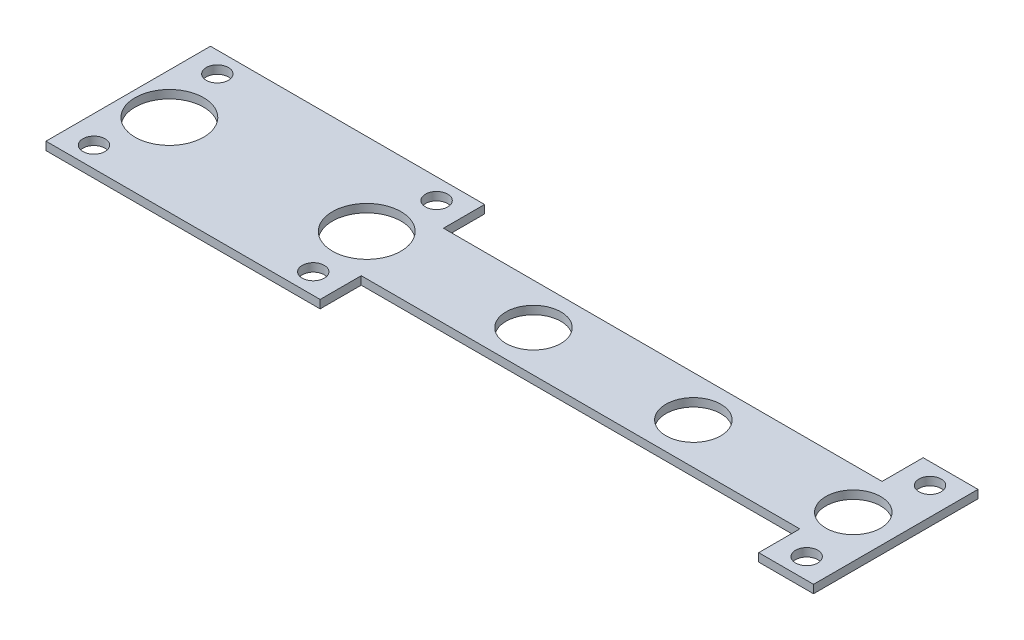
ISO-10303-21;
HEADER;
FILE_DESCRIPTION(('STEP AP214'),'2;1');
FILE_NAME('part.step','',(''),(''),'','','');
FILE_SCHEMA(('AUTOMOTIVE_DESIGN { 1 0 10303 214 1 1 1 1 }'));
ENDSEC;
DATA;
#1=APPLICATION_CONTEXT('core data for automotive mechanical design processes');
#2=APPLICATION_PROTOCOL_DEFINITION('international standard','automotive_design',2000,#1);
#3=PRODUCT_CONTEXT('',#1,'mechanical');
#4=PRODUCT('Part','Part','',(#3));
#5=PRODUCT_RELATED_PRODUCT_CATEGORY('part','',(#4));
#6=PRODUCT_DEFINITION_FORMATION('','',#4);
#7=PRODUCT_DEFINITION_CONTEXT('part definition',#1,'design');
#8=PRODUCT_DEFINITION('design','',#6,#7);
#9=PRODUCT_DEFINITION_SHAPE('','',#8);
#10=(LENGTH_UNIT() NAMED_UNIT(*) SI_UNIT(.MILLI.,.METRE.));
#11=(NAMED_UNIT(*) PLANE_ANGLE_UNIT() SI_UNIT($,.RADIAN.));
#12=(NAMED_UNIT(*) SI_UNIT($,.STERADIAN.) SOLID_ANGLE_UNIT());
#13=UNCERTAINTY_MEASURE_WITH_UNIT(LENGTH_MEASURE(1.E-05),#10,'distance_accuracy_value','');
#14=(GEOMETRIC_REPRESENTATION_CONTEXT(3) GLOBAL_UNCERTAINTY_ASSIGNED_CONTEXT((#13)) GLOBAL_UNIT_ASSIGNED_CONTEXT((#10,
#11,#12)) REPRESENTATION_CONTEXT('',''));
#15=CARTESIAN_POINT('',(0.,0.,0.));
#16=DIRECTION('',(0.,0.,1.));
#17=DIRECTION('',(1.,0.,0.));
#18=AXIS2_PLACEMENT_3D('',#15,#16,#17);
#19=CARTESIAN_POINT('',(0.,3.,0.));
#20=DIRECTION('',(0.,1.,0.));
#21=DIRECTION('',(0.,0.,1.));
#22=AXIS2_PLACEMENT_3D('',#19,#20,#21);
#23=PLANE('',#22);
#24=CARTESIAN_POINT('',(45.0731259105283,3.,-0.336908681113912));
#25=DIRECTION('',(0.,1.,0.));
#26=DIRECTION('',(0.,0.,1.));
#27=AXIS2_PLACEMENT_3D('',#24,#25,#26);
#28=CIRCLE('',#27,10.);
#29=CARTESIAN_POINT('',(45.0731259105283,3.,9.66309131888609));
#30=VERTEX_POINT('',#29);
#31=EDGE_CURVE('E319',#30,#30,#28,.T.);
#32=ORIENTED_EDGE('',*,*,#31,.F.);
#33=EDGE_LOOP('',(#32));
#34=FACE_BOUND('',#33,.T.);
#35=CARTESIAN_POINT('',(-15.7602074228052,3.,-0.336908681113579));
#36=DIRECTION('',(0.,1.,0.));
#37=DIRECTION('',(0.,0.,1.));
#38=AXIS2_PLACEMENT_3D('',#35,#36,#37);
#39=CIRCLE('',#38,12.5);
#40=CARTESIAN_POINT('',(-15.7602074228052,3.,12.1630913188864));
#41=VERTEX_POINT('',#40);
#42=EDGE_CURVE('E331',#41,#41,#39,.T.);
#43=ORIENTED_EDGE('',*,*,#42,.F.);
#44=EDGE_LOOP('',(#43));
#45=FACE_BOUND('',#44,.T.);
#46=CARTESIAN_POINT('',(-87.7602074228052,3.,-0.336908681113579));
#47=DIRECTION('',(0.,1.,0.));
#48=DIRECTION('',(0.,0.,1.));
#49=AXIS2_PLACEMENT_3D('',#46,#47,#48);
#50=CIRCLE('',#49,12.5);
#51=CARTESIAN_POINT('',(-87.7602074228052,3.,12.1630913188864));
#52=VERTEX_POINT('',#51);
#53=EDGE_CURVE('E343',#52,#52,#50,.T.);
#54=ORIENTED_EDGE('',*,*,#53,.F.);
#55=EDGE_LOOP('',(#54));
#56=FACE_BOUND('',#55,.T.);
#57=CARTESIAN_POINT('',(167.239792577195,3.,-22.8369086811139));
#58=DIRECTION('',(0.,1.,0.));
#59=DIRECTION('',(0.,0.,1.));
#60=AXIS2_PLACEMENT_3D('',#57,#58,#59);
#61=CIRCLE('',#60,4.04999999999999);
#62=CARTESIAN_POINT('',(167.239792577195,3.,-18.7869086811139));
#63=VERTEX_POINT('',#62);
#64=EDGE_CURVE('E355',#63,#63,#61,.T.);
#65=ORIENTED_EDGE('',*,*,#64,.F.);
#66=EDGE_LOOP('',(#65));
#67=FACE_BOUND('',#66,.T.);
#68=CARTESIAN_POINT('',(167.239792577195,3.,22.1630913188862));
#69=DIRECTION('',(0.,1.,0.));
#70=DIRECTION('',(0.,0.,1.));
#71=AXIS2_PLACEMENT_3D('',#68,#69,#70);
#72=CIRCLE('',#71,4.04999999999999);
#73=CARTESIAN_POINT('',(167.239792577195,3.,26.2130913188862));
#74=VERTEX_POINT('',#73);
#75=EDGE_CURVE('E367',#74,#74,#72,.T.);
#76=ORIENTED_EDGE('',*,*,#75,.F.);
#77=EDGE_LOOP('',(#76));
#78=FACE_BOUND('',#77,.T.);
#79=DIRECTION('',(0.,0.,1.));
#80=VECTOR('',#79,1.);
#81=CARTESIAN_POINT('',(-102.760207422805,3.,-30.3369086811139));
#82=LINE('',#81,#80);
#83=CARTESIAN_POINT('',(-102.760207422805,3.,-30.3369086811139));
#84=VERTEX_POINT('',#83);
#85=CARTESIAN_POINT('',(-102.760207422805,3.,29.663091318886));
#86=VERTEX_POINT('',#85);
#87=EDGE_CURVE('E176',#84,#86,#82,.T.);
#88=ORIENTED_EDGE('',*,*,#87,.T.);
#89=DIRECTION('',(1.,0.,0.));
#90=VECTOR('',#89,1.);
#91=CARTESIAN_POINT('',(-102.760207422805,3.,29.663091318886));
#92=LINE('',#91,#90);
#93=CARTESIAN_POINT('',(-2.76020742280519,3.,29.663091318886));
#94=VERTEX_POINT('',#93);
#95=EDGE_CURVE('E104',#86,#94,#92,.T.);
#96=ORIENTED_EDGE('',*,*,#95,.T.);
#97=DIRECTION('',(0.,0.,-1.));
#98=VECTOR('',#97,1.);
#99=CARTESIAN_POINT('',(-2.76020742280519,3.,29.663091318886));
#100=LINE('',#99,#98);
#101=CARTESIAN_POINT('',(-2.76020742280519,3.,14.663091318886));
#102=VERTEX_POINT('',#101);
#103=EDGE_CURVE('E203',#94,#102,#100,.T.);
#104=ORIENTED_EDGE('',*,*,#103,.T.);
#105=DIRECTION('',(1.,0.,0.));
#106=VECTOR('',#105,1.);
#107=CARTESIAN_POINT('',(-2.76020742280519,3.,14.663091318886));
#108=LINE('',#107,#106);
#109=CARTESIAN_POINT('',(157.239792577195,3.,14.663091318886));
#110=VERTEX_POINT('',#109);
#111=EDGE_CURVE('E222',#102,#110,#108,.T.);
#112=ORIENTED_EDGE('',*,*,#111,.T.);
#113=DIRECTION('',(0.,0.,1.));
#114=VECTOR('',#113,1.);
#115=CARTESIAN_POINT('',(157.239792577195,3.,14.663091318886));
#116=LINE('',#115,#114);
#117=CARTESIAN_POINT('',(157.239792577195,3.,29.663091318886));
#118=VERTEX_POINT('',#117);
#119=EDGE_CURVE('E219',#110,#118,#116,.T.);
#120=ORIENTED_EDGE('',*,*,#119,.T.);
#121=DIRECTION('',(1.,0.,0.));
#122=VECTOR('',#121,1.);
#123=CARTESIAN_POINT('',(157.239792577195,3.,29.663091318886));
#124=LINE('',#123,#122);
#125=CARTESIAN_POINT('',(177.239792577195,3.,29.663091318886));
#126=VERTEX_POINT('',#125);
#127=EDGE_CURVE('E221',#118,#126,#124,.T.);
#128=ORIENTED_EDGE('',*,*,#127,.T.);
#129=DIRECTION('',(0.,0.,-1.));
#130=VECTOR('',#129,1.);
#131=CARTESIAN_POINT('',(177.239792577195,3.,29.663091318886));
#132=LINE('',#131,#130);
#133=CARTESIAN_POINT('',(177.239792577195,3.,-30.3369086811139));
#134=VERTEX_POINT('',#133);
#135=EDGE_CURVE('E224',#126,#134,#132,.T.);
#136=ORIENTED_EDGE('',*,*,#135,.T.);
#137=DIRECTION('',(-1.,0.,0.));
#138=VECTOR('',#137,1.);
#139=CARTESIAN_POINT('',(177.239792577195,3.,-30.3369086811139));
#140=LINE('',#139,#138);
#141=CARTESIAN_POINT('',(157.239792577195,3.,-30.3369086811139));
#142=VERTEX_POINT('',#141);
#143=EDGE_CURVE('E230',#134,#142,#140,.T.);
#144=ORIENTED_EDGE('',*,*,#143,.T.);
#145=DIRECTION('',(0.,0.,1.));
#146=VECTOR('',#145,1.);
#147=CARTESIAN_POINT('',(157.239792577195,3.,-30.3369086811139));
#148=LINE('',#147,#146);
#149=CARTESIAN_POINT('',(157.239792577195,3.,-15.3369086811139));
#150=VERTEX_POINT('',#149);
#151=EDGE_CURVE('E135',#142,#150,#148,.T.);
#152=ORIENTED_EDGE('',*,*,#151,.T.);
#153=DIRECTION('',(-1.,0.,0.));
#154=VECTOR('',#153,1.);
#155=CARTESIAN_POINT('',(157.239792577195,3.,-15.3369086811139));
#156=LINE('',#155,#154);
#157=CARTESIAN_POINT('',(-2.76020742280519,3.,-15.3369086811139));
#158=VERTEX_POINT('',#157);
#159=EDGE_CURVE('E129',#150,#158,#156,.T.);
#160=ORIENTED_EDGE('',*,*,#159,.T.);
#161=DIRECTION('',(0.,0.,-1.));
#162=VECTOR('',#161,1.);
#163=CARTESIAN_POINT('',(-2.76020742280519,3.,-15.3369086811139));
#164=LINE('',#163,#162);
#165=CARTESIAN_POINT('',(-2.76020742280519,3.,-30.3369086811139));
#166=VERTEX_POINT('',#165);
#167=EDGE_CURVE('E133',#158,#166,#164,.T.);
#168=ORIENTED_EDGE('',*,*,#167,.T.);
#169=DIRECTION('',(-1.,0.,0.));
#170=VECTOR('',#169,1.);
#171=CARTESIAN_POINT('',(-2.76020742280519,3.,-30.3369086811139));
#172=LINE('',#171,#170);
#173=EDGE_CURVE('E49',#166,#84,#172,.T.);
#174=ORIENTED_EDGE('',*,*,#173,.T.);
#175=EDGE_LOOP('',(#88,#96,#104,#112,#120,#128,#136,#144,#152,#160,#168,#174));
#176=FACE_BOUND('',#175,.T.);
#177=CARTESIAN_POINT('',(-12.76020742,3.,22.163091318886));
#178=DIRECTION('',(0.,1.,0.));
#179=DIRECTION('',(0.,0.,1.));
#180=AXIS2_PLACEMENT_3D('',#177,#178,#179);
#181=CIRCLE('',#180,4.04999999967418);
#182=CARTESIAN_POINT('',(-12.76020742,3.,26.2130913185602));
#183=VERTEX_POINT('',#182);
#184=EDGE_CURVE('E157',#183,#183,#181,.T.);
#185=ORIENTED_EDGE('',*,*,#184,.F.);
#186=EDGE_LOOP('',(#185));
#187=FACE_BOUND('',#186,.T.);
#188=CARTESIAN_POINT('',(-92.76020742,3.,22.1630913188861));
#189=DIRECTION('',(0.,1.,0.));
#190=DIRECTION('',(0.,0.,1.));
#191=AXIS2_PLACEMENT_3D('',#188,#189,#190);
#192=CIRCLE('',#191,4.04999999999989);
#193=CARTESIAN_POINT('',(-92.76020742,3.,26.2130913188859));
#194=VERTEX_POINT('',#193);
#195=EDGE_CURVE('E361',#194,#194,#192,.T.);
#196=ORIENTED_EDGE('',*,*,#195,.F.);
#197=EDGE_LOOP('',(#196));
#198=FACE_BOUND('',#197,.T.);
#199=CARTESIAN_POINT('',(-92.76020742,3.,-22.8369086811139));
#200=DIRECTION('',(0.,1.,0.));
#201=DIRECTION('',(0.,0.,1.));
#202=AXIS2_PLACEMENT_3D('',#199,#200,#201);
#203=CIRCLE('',#202,4.05);
#204=CARTESIAN_POINT('',(-92.76020742,3.,-18.7869086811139));
#205=VERTEX_POINT('',#204);
#206=EDGE_CURVE('E349',#205,#205,#203,.T.);
#207=ORIENTED_EDGE('',*,*,#206,.F.);
#208=EDGE_LOOP('',(#207));
#209=FACE_BOUND('',#208,.T.);
#210=CARTESIAN_POINT('',(161.739792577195,3.,-0.336908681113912));
#211=DIRECTION('',(0.,1.,0.));
#212=DIRECTION('',(0.,0.,1.));
#213=AXIS2_PLACEMENT_3D('',#210,#211,#212);
#214=CIRCLE('',#213,10.);
#215=CARTESIAN_POINT('',(161.739792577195,3.,9.6630913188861));
#216=VERTEX_POINT('',#215);
#217=EDGE_CURVE('E337',#216,#216,#214,.T.);
#218=ORIENTED_EDGE('',*,*,#217,.F.);
#219=EDGE_LOOP('',(#218));
#220=FACE_BOUND('',#219,.T.);
#221=CARTESIAN_POINT('',(-12.76020742,3.,-22.83690868));
#222=DIRECTION('',(0.,1.,0.));
#223=DIRECTION('',(0.,0.,1.));
#224=AXIS2_PLACEMENT_3D('',#221,#222,#223);
#225=CIRCLE('',#224,4.05);
#226=CARTESIAN_POINT('',(-12.76020742,3.,-18.78690868));
#227=VERTEX_POINT('',#226);
#228=EDGE_CURVE('E325',#227,#227,#225,.T.);
#229=ORIENTED_EDGE('',*,*,#228,.F.);
#230=EDGE_LOOP('',(#229));
#231=FACE_BOUND('',#230,.T.);
#232=CARTESIAN_POINT('',(103.406459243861,3.,-0.336908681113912));
#233=DIRECTION('',(0.,1.,0.));
#234=DIRECTION('',(0.,0.,1.));
#235=AXIS2_PLACEMENT_3D('',#232,#233,#234);
#236=CIRCLE('',#235,10.);
#237=CARTESIAN_POINT('',(103.406459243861,3.,9.6630913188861));
#238=VERTEX_POINT('',#237);
#239=EDGE_CURVE('E310',#238,#238,#236,.T.);
#240=ORIENTED_EDGE('',*,*,#239,.F.);
#241=EDGE_LOOP('',(#240));
#242=FACE_BOUND('',#241,.T.);
#243=ADVANCED_FACE('F32',(#34,#45,#56,#67,#78,#176,#187,#198,#209,#220,#231,#242),#23,.T.);
#244=CARTESIAN_POINT('',(0.,0.,0.));
#245=DIRECTION('',(0.,1.,0.));
#246=DIRECTION('',(0.,0.,1.));
#247=AXIS2_PLACEMENT_3D('',#244,#245,#246);
#248=PLANE('',#247);
#249=CARTESIAN_POINT('',(45.0731259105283,0.,-0.336908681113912));
#250=DIRECTION('',(0.,1.,0.));
#251=DIRECTION('',(0.,0.,1.));
#252=AXIS2_PLACEMENT_3D('',#249,#250,#251);
#253=CIRCLE('',#252,10.);
#254=CARTESIAN_POINT('',(45.0731259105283,0.,9.66309131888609));
#255=VERTEX_POINT('',#254);
#256=EDGE_CURVE('E316',#255,#255,#253,.T.);
#257=ORIENTED_EDGE('',*,*,#256,.T.);
#258=EDGE_LOOP('',(#257));
#259=FACE_BOUND('',#258,.T.);
#260=CARTESIAN_POINT('',(-15.7602074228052,0.,-0.336908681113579));
#261=DIRECTION('',(0.,1.,0.));
#262=DIRECTION('',(0.,0.,1.));
#263=AXIS2_PLACEMENT_3D('',#260,#261,#262);
#264=CIRCLE('',#263,12.5);
#265=CARTESIAN_POINT('',(-15.7602074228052,0.,12.1630913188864));
#266=VERTEX_POINT('',#265);
#267=EDGE_CURVE('E328',#266,#266,#264,.T.);
#268=ORIENTED_EDGE('',*,*,#267,.T.);
#269=EDGE_LOOP('',(#268));
#270=FACE_BOUND('',#269,.T.);
#271=CARTESIAN_POINT('',(-87.7602074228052,0.,-0.336908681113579));
#272=DIRECTION('',(0.,1.,0.));
#273=DIRECTION('',(0.,0.,1.));
#274=AXIS2_PLACEMENT_3D('',#271,#272,#273);
#275=CIRCLE('',#274,12.5);
#276=CARTESIAN_POINT('',(-87.7602074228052,0.,12.1630913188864));
#277=VERTEX_POINT('',#276);
#278=EDGE_CURVE('E340',#277,#277,#275,.T.);
#279=ORIENTED_EDGE('',*,*,#278,.T.);
#280=EDGE_LOOP('',(#279));
#281=FACE_BOUND('',#280,.T.);
#282=CARTESIAN_POINT('',(167.239792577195,0.,-22.8369086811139));
#283=DIRECTION('',(0.,1.,0.));
#284=DIRECTION('',(0.,0.,1.));
#285=AXIS2_PLACEMENT_3D('',#282,#283,#284);
#286=CIRCLE('',#285,4.04999999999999);
#287=CARTESIAN_POINT('',(167.239792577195,0.,-18.7869086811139));
#288=VERTEX_POINT('',#287);
#289=EDGE_CURVE('E352',#288,#288,#286,.T.);
#290=ORIENTED_EDGE('',*,*,#289,.T.);
#291=EDGE_LOOP('',(#290));
#292=FACE_BOUND('',#291,.T.);
#293=CARTESIAN_POINT('',(167.239792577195,0.,22.1630913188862));
#294=DIRECTION('',(0.,1.,0.));
#295=DIRECTION('',(0.,0.,1.));
#296=AXIS2_PLACEMENT_3D('',#293,#294,#295);
#297=CIRCLE('',#296,4.04999999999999);
#298=CARTESIAN_POINT('',(167.239792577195,0.,26.2130913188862));
#299=VERTEX_POINT('',#298);
#300=EDGE_CURVE('E364',#299,#299,#297,.T.);
#301=ORIENTED_EDGE('',*,*,#300,.T.);
#302=EDGE_LOOP('',(#301));
#303=FACE_BOUND('',#302,.T.);
#304=DIRECTION('',(0.,0.,1.));
#305=VECTOR('',#304,1.);
#306=CARTESIAN_POINT('',(-102.760207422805,0.,-30.3369086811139));
#307=LINE('',#306,#305);
#308=CARTESIAN_POINT('',(-102.760207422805,0.,-30.3369086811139));
#309=VERTEX_POINT('',#308);
#310=CARTESIAN_POINT('',(-102.760207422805,0.,29.663091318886));
#311=VERTEX_POINT('',#310);
#312=EDGE_CURVE('E153',#309,#311,#307,.T.);
#313=ORIENTED_EDGE('',*,*,#312,.F.);
#314=DIRECTION('',(-1.,0.,0.));
#315=VECTOR('',#314,1.);
#316=CARTESIAN_POINT('',(-2.76020742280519,0.,-30.3369086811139));
#317=LINE('',#316,#315);
#318=CARTESIAN_POINT('',(-2.76020742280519,0.,-30.3369086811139));
#319=VERTEX_POINT('',#318);
#320=EDGE_CURVE('E96',#319,#309,#317,.T.);
#321=ORIENTED_EDGE('',*,*,#320,.F.);
#322=DIRECTION('',(0.,0.,-1.));
#323=VECTOR('',#322,1.);
#324=CARTESIAN_POINT('',(-2.76020742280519,0.,-15.3369086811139));
#325=LINE('',#324,#323);
#326=CARTESIAN_POINT('',(-2.76020742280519,0.,-15.3369086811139));
#327=VERTEX_POINT('',#326);
#328=EDGE_CURVE('E90',#327,#319,#325,.T.);
#329=ORIENTED_EDGE('',*,*,#328,.F.);
#330=DIRECTION('',(-1.,0.,0.));
#331=VECTOR('',#330,1.);
#332=CARTESIAN_POINT('',(157.239792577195,0.,-15.3369086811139));
#333=LINE('',#332,#331);
#334=CARTESIAN_POINT('',(157.239792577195,0.,-15.3369086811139));
#335=VERTEX_POINT('',#334);
#336=EDGE_CURVE('E143',#335,#327,#333,.T.);
#337=ORIENTED_EDGE('',*,*,#336,.F.);
#338=DIRECTION('',(0.,0.,1.));
#339=VECTOR('',#338,1.);
#340=CARTESIAN_POINT('',(157.239792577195,0.,-30.3369086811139));
#341=LINE('',#340,#339);
#342=CARTESIAN_POINT('',(157.239792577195,0.,-30.3369086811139));
#343=VERTEX_POINT('',#342);
#344=EDGE_CURVE('E171',#343,#335,#341,.T.);
#345=ORIENTED_EDGE('',*,*,#344,.F.);
#346=DIRECTION('',(-1.,0.,0.));
#347=VECTOR('',#346,1.);
#348=CARTESIAN_POINT('',(177.239792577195,0.,-30.3369086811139));
#349=LINE('',#348,#347);
#350=CARTESIAN_POINT('',(177.239792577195,0.,-30.3369086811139));
#351=VERTEX_POINT('',#350);
#352=EDGE_CURVE('E169',#351,#343,#349,.T.);
#353=ORIENTED_EDGE('',*,*,#352,.F.);
#354=DIRECTION('',(0.,0.,-1.));
#355=VECTOR('',#354,1.);
#356=CARTESIAN_POINT('',(177.239792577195,0.,29.663091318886));
#357=LINE('',#356,#355);
#358=CARTESIAN_POINT('',(177.239792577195,0.,29.663091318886));
#359=VERTEX_POINT('',#358);
#360=EDGE_CURVE('E167',#359,#351,#357,.T.);
#361=ORIENTED_EDGE('',*,*,#360,.F.);
#362=DIRECTION('',(1.,0.,0.));
#363=VECTOR('',#362,1.);
#364=CARTESIAN_POINT('',(157.239792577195,0.,29.663091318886));
#365=LINE('',#364,#363);
#366=CARTESIAN_POINT('',(157.239792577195,0.,29.663091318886));
#367=VERTEX_POINT('',#366);
#368=EDGE_CURVE('E165',#367,#359,#365,.T.);
#369=ORIENTED_EDGE('',*,*,#368,.F.);
#370=DIRECTION('',(0.,0.,1.));
#371=VECTOR('',#370,1.);
#372=CARTESIAN_POINT('',(157.239792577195,0.,14.663091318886));
#373=LINE('',#372,#371);
#374=CARTESIAN_POINT('',(157.239792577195,0.,14.663091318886));
#375=VERTEX_POINT('',#374);
#376=EDGE_CURVE('E163',#375,#367,#373,.T.);
#377=ORIENTED_EDGE('',*,*,#376,.F.);
#378=DIRECTION('',(1.,0.,0.));
#379=VECTOR('',#378,1.);
#380=CARTESIAN_POINT('',(-2.76020742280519,0.,14.663091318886));
#381=LINE('',#380,#379);
#382=CARTESIAN_POINT('',(-2.76020742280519,0.,14.663091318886));
#383=VERTEX_POINT('',#382);
#384=EDGE_CURVE('E161',#383,#375,#381,.T.);
#385=ORIENTED_EDGE('',*,*,#384,.F.);
#386=DIRECTION('',(0.,0.,-1.));
#387=VECTOR('',#386,1.);
#388=CARTESIAN_POINT('',(-2.76020742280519,0.,29.663091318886));
#389=LINE('',#388,#387);
#390=CARTESIAN_POINT('',(-2.76020742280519,0.,29.663091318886));
#391=VERTEX_POINT('',#390);
#392=EDGE_CURVE('E159',#391,#383,#389,.T.);
#393=ORIENTED_EDGE('',*,*,#392,.F.);
#394=DIRECTION('',(1.,0.,0.));
#395=VECTOR('',#394,1.);
#396=CARTESIAN_POINT('',(-102.760207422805,0.,29.663091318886));
#397=LINE('',#396,#395);
#398=EDGE_CURVE('E156',#311,#391,#397,.T.);
#399=ORIENTED_EDGE('',*,*,#398,.F.);
#400=EDGE_LOOP('',(#313,#321,#329,#337,#345,#353,#361,#369,#377,#385,#393,#399));
#401=FACE_BOUND('',#400,.T.);
#402=CARTESIAN_POINT('',(-12.76020742,0.,22.163091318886));
#403=DIRECTION('',(0.,1.,0.));
#404=DIRECTION('',(0.,0.,1.));
#405=AXIS2_PLACEMENT_3D('',#402,#403,#404);
#406=CIRCLE('',#405,4.04999999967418);
#407=CARTESIAN_POINT('',(-12.76020742,0.,26.2130913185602));
#408=VERTEX_POINT('',#407);
#409=EDGE_CURVE('E370',#408,#408,#406,.T.);
#410=ORIENTED_EDGE('',*,*,#409,.T.);
#411=EDGE_LOOP('',(#410));
#412=FACE_BOUND('',#411,.T.);
#413=CARTESIAN_POINT('',(-92.76020742,0.,22.1630913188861));
#414=DIRECTION('',(0.,1.,0.));
#415=DIRECTION('',(0.,0.,1.));
#416=AXIS2_PLACEMENT_3D('',#413,#414,#415);
#417=CIRCLE('',#416,4.04999999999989);
#418=CARTESIAN_POINT('',(-92.76020742,0.,26.2130913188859));
#419=VERTEX_POINT('',#418);
#420=EDGE_CURVE('E358',#419,#419,#417,.T.);
#421=ORIENTED_EDGE('',*,*,#420,.T.);
#422=EDGE_LOOP('',(#421));
#423=FACE_BOUND('',#422,.T.);
#424=CARTESIAN_POINT('',(-92.76020742,0.,-22.8369086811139));
#425=DIRECTION('',(0.,1.,0.));
#426=DIRECTION('',(0.,0.,1.));
#427=AXIS2_PLACEMENT_3D('',#424,#425,#426);
#428=CIRCLE('',#427,4.05);
#429=CARTESIAN_POINT('',(-92.76020742,0.,-18.7869086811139));
#430=VERTEX_POINT('',#429);
#431=EDGE_CURVE('E346',#430,#430,#428,.T.);
#432=ORIENTED_EDGE('',*,*,#431,.T.);
#433=EDGE_LOOP('',(#432));
#434=FACE_BOUND('',#433,.T.);
#435=CARTESIAN_POINT('',(161.739792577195,0.,-0.336908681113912));
#436=DIRECTION('',(0.,1.,0.));
#437=DIRECTION('',(0.,0.,1.));
#438=AXIS2_PLACEMENT_3D('',#435,#436,#437);
#439=CIRCLE('',#438,10.);
#440=CARTESIAN_POINT('',(161.739792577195,0.,9.6630913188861));
#441=VERTEX_POINT('',#440);
#442=EDGE_CURVE('E334',#441,#441,#439,.T.);
#443=ORIENTED_EDGE('',*,*,#442,.T.);
#444=EDGE_LOOP('',(#443));
#445=FACE_BOUND('',#444,.T.);
#446=CARTESIAN_POINT('',(-12.76020742,0.,-22.83690868));
#447=DIRECTION('',(0.,1.,0.));
#448=DIRECTION('',(0.,0.,1.));
#449=AXIS2_PLACEMENT_3D('',#446,#447,#448);
#450=CIRCLE('',#449,4.05);
#451=CARTESIAN_POINT('',(-12.76020742,0.,-18.78690868));
#452=VERTEX_POINT('',#451);
#453=EDGE_CURVE('E322',#452,#452,#450,.T.);
#454=ORIENTED_EDGE('',*,*,#453,.T.);
#455=EDGE_LOOP('',(#454));
#456=FACE_BOUND('',#455,.T.);
#457=CARTESIAN_POINT('',(103.406459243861,0.,-0.336908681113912));
#458=DIRECTION('',(0.,1.,0.));
#459=DIRECTION('',(0.,0.,1.));
#460=AXIS2_PLACEMENT_3D('',#457,#458,#459);
#461=CIRCLE('',#460,10.);
#462=CARTESIAN_POINT('',(103.406459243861,0.,9.6630913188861));
#463=VERTEX_POINT('',#462);
#464=EDGE_CURVE('E313',#463,#463,#461,.T.);
#465=ORIENTED_EDGE('',*,*,#464,.T.);
#466=EDGE_LOOP('',(#465));
#467=FACE_BOUND('',#466,.T.);
#468=ADVANCED_FACE('F207',(#259,#270,#281,#292,#303,#401,#412,#423,#434,#445,#456,#467),#248,.F.);
#469=CARTESIAN_POINT('',(-102.760207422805,3.,-30.3369086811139));
#470=DIRECTION('',(1.,0.,0.));
#471=DIRECTION('',(0.,0.,-1.));
#472=AXIS2_PLACEMENT_3D('',#469,#470,#471);
#473=PLANE('',#472);
#474=ORIENTED_EDGE('',*,*,#312,.T.);
#475=DIRECTION('',(0.,-1.,0.));
#476=VECTOR('',#475,1.);
#477=CARTESIAN_POINT('',(-102.760207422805,3.,29.663091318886));
#478=LINE('',#477,#476);
#479=EDGE_CURVE('E11',#86,#311,#478,.T.);
#480=ORIENTED_EDGE('',*,*,#479,.F.);
#481=ORIENTED_EDGE('',*,*,#87,.F.);
#482=DIRECTION('',(0.,-1.,0.));
#483=VECTOR('',#482,1.);
#484=CARTESIAN_POINT('',(-102.760207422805,3.,-30.3369086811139));
#485=LINE('',#484,#483);
#486=EDGE_CURVE('E149',#84,#309,#485,.T.);
#487=ORIENTED_EDGE('',*,*,#486,.T.);
#488=EDGE_LOOP('',(#474,#480,#481,#487));
#489=FACE_BOUND('',#488,.T.);
#490=ADVANCED_FACE('F34',(#489),#473,.F.);
#491=CARTESIAN_POINT('',(-102.760207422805,3.,29.663091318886));
#492=DIRECTION('',(0.,0.,-1.));
#493=DIRECTION('',(-1.,0.,0.));
#494=AXIS2_PLACEMENT_3D('',#491,#492,#493);
#495=PLANE('',#494);
#496=ORIENTED_EDGE('',*,*,#398,.T.);
#497=DIRECTION('',(0.,-1.,0.));
#498=VECTOR('',#497,1.);
#499=CARTESIAN_POINT('',(-2.76020742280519,3.,29.663091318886));
#500=LINE('',#499,#498);
#501=EDGE_CURVE('E41',#94,#391,#500,.T.);
#502=ORIENTED_EDGE('',*,*,#501,.F.);
#503=ORIENTED_EDGE('',*,*,#95,.F.);
#504=ORIENTED_EDGE('',*,*,#479,.T.);
#505=EDGE_LOOP('',(#496,#502,#503,#504));
#506=FACE_BOUND('',#505,.T.);
#507=ADVANCED_FACE('F542',(#506),#495,.F.);
#508=CARTESIAN_POINT('',(-2.76020742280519,3.,29.663091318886));
#509=DIRECTION('',(-1.,0.,0.));
#510=DIRECTION('',(0.,0.,1.));
#511=AXIS2_PLACEMENT_3D('',#508,#509,#510);
#512=PLANE('',#511);
#513=ORIENTED_EDGE('',*,*,#392,.T.);
#514=DIRECTION('',(0.,-1.,0.));
#515=VECTOR('',#514,1.);
#516=CARTESIAN_POINT('',(-2.76020742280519,3.,14.663091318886));
#517=LINE('',#516,#515);
#518=EDGE_CURVE('E195',#102,#383,#517,.T.);
#519=ORIENTED_EDGE('',*,*,#518,.F.);
#520=ORIENTED_EDGE('',*,*,#103,.F.);
#521=ORIENTED_EDGE('',*,*,#501,.T.);
#522=EDGE_LOOP('',(#513,#519,#520,#521));
#523=FACE_BOUND('',#522,.T.);
#524=ADVANCED_FACE('F201',(#523),#512,.F.);
#525=CARTESIAN_POINT('',(-2.76020742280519,3.,14.663091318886));
#526=DIRECTION('',(0.,0.,-1.));
#527=DIRECTION('',(-1.,0.,0.));
#528=AXIS2_PLACEMENT_3D('',#525,#526,#527);
#529=PLANE('',#528);
#530=ORIENTED_EDGE('',*,*,#384,.T.);
#531=DIRECTION('',(0.,-1.,0.));
#532=VECTOR('',#531,1.);
#533=CARTESIAN_POINT('',(157.239792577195,3.,14.663091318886));
#534=LINE('',#533,#532);
#535=EDGE_CURVE('E192',#110,#375,#534,.T.);
#536=ORIENTED_EDGE('',*,*,#535,.F.);
#537=ORIENTED_EDGE('',*,*,#111,.F.);
#538=ORIENTED_EDGE('',*,*,#518,.T.);
#539=EDGE_LOOP('',(#530,#536,#537,#538));
#540=FACE_BOUND('',#539,.T.);
#541=ADVANCED_FACE('F213',(#540),#529,.F.);
#542=CARTESIAN_POINT('',(157.239792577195,3.,14.663091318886));
#543=DIRECTION('',(1.,0.,0.));
#544=DIRECTION('',(0.,0.,-1.));
#545=AXIS2_PLACEMENT_3D('',#542,#543,#544);
#546=PLANE('',#545);
#547=ORIENTED_EDGE('',*,*,#376,.T.);
#548=DIRECTION('',(0.,-1.,0.));
#549=VECTOR('',#548,1.);
#550=CARTESIAN_POINT('',(157.239792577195,3.,29.663091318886));
#551=LINE('',#550,#549);
#552=EDGE_CURVE('E189',#118,#367,#551,.T.);
#553=ORIENTED_EDGE('',*,*,#552,.F.);
#554=ORIENTED_EDGE('',*,*,#119,.F.);
#555=ORIENTED_EDGE('',*,*,#535,.T.);
#556=EDGE_LOOP('',(#547,#553,#554,#555));
#557=FACE_BOUND('',#556,.T.);
#558=ADVANCED_FACE('F217',(#557),#546,.F.);
#559=CARTESIAN_POINT('',(157.239792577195,3.,29.663091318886));
#560=DIRECTION('',(0.,0.,-1.));
#561=DIRECTION('',(-1.,0.,0.));
#562=AXIS2_PLACEMENT_3D('',#559,#560,#561);
#563=PLANE('',#562);
#564=ORIENTED_EDGE('',*,*,#368,.T.);
#565=DIRECTION('',(0.,-1.,0.));
#566=VECTOR('',#565,1.);
#567=CARTESIAN_POINT('',(177.239792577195,3.,29.663091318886));
#568=LINE('',#567,#566);
#569=EDGE_CURVE('E186',#126,#359,#568,.T.);
#570=ORIENTED_EDGE('',*,*,#569,.F.);
#571=ORIENTED_EDGE('',*,*,#127,.F.);
#572=ORIENTED_EDGE('',*,*,#552,.T.);
#573=EDGE_LOOP('',(#564,#570,#571,#572));
#574=FACE_BOUND('',#573,.T.);
#575=ADVANCED_FACE('F507',(#574),#563,.F.);
#576=CARTESIAN_POINT('',(177.239792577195,3.,29.663091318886));
#577=DIRECTION('',(-1.,0.,0.));
#578=DIRECTION('',(0.,0.,1.));
#579=AXIS2_PLACEMENT_3D('',#576,#577,#578);
#580=PLANE('',#579);
#581=ORIENTED_EDGE('',*,*,#360,.T.);
#582=DIRECTION('',(0.,-1.,0.));
#583=VECTOR('',#582,1.);
#584=CARTESIAN_POINT('',(177.239792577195,3.,-30.3369086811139));
#585=LINE('',#584,#583);
#586=EDGE_CURVE('E183',#134,#351,#585,.T.);
#587=ORIENTED_EDGE('',*,*,#586,.F.);
#588=ORIENTED_EDGE('',*,*,#135,.F.);
#589=ORIENTED_EDGE('',*,*,#569,.T.);
#590=EDGE_LOOP('',(#581,#587,#588,#589));
#591=FACE_BOUND('',#590,.T.);
#592=ADVANCED_FACE('F498',(#591),#580,.F.);
#593=CARTESIAN_POINT('',(177.239792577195,3.,-30.3369086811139));
#594=DIRECTION('',(0.,0.,1.));
#595=DIRECTION('',(1.,0.,0.));
#596=AXIS2_PLACEMENT_3D('',#593,#594,#595);
#597=PLANE('',#596);
#598=ORIENTED_EDGE('',*,*,#352,.T.);
#599=DIRECTION('',(0.,-1.,0.));
#600=VECTOR('',#599,1.);
#601=CARTESIAN_POINT('',(157.239792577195,3.,-30.3369086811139));
#602=LINE('',#601,#600);
#603=EDGE_CURVE('E180',#142,#343,#602,.T.);
#604=ORIENTED_EDGE('',*,*,#603,.F.);
#605=ORIENTED_EDGE('',*,*,#143,.F.);
#606=ORIENTED_EDGE('',*,*,#586,.T.);
#607=EDGE_LOOP('',(#598,#604,#605,#606));
#608=FACE_BOUND('',#607,.T.);
#609=ADVANCED_FACE('F236',(#608),#597,.F.);
#610=CARTESIAN_POINT('',(157.239792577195,3.,-30.3369086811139));
#611=DIRECTION('',(1.,0.,0.));
#612=DIRECTION('',(0.,0.,-1.));
#613=AXIS2_PLACEMENT_3D('',#610,#611,#612);
#614=PLANE('',#613);
#615=ORIENTED_EDGE('',*,*,#344,.T.);
#616=DIRECTION('',(0.,-1.,0.));
#617=VECTOR('',#616,1.);
#618=CARTESIAN_POINT('',(157.239792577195,3.,-15.3369086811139));
#619=LINE('',#618,#617);
#620=EDGE_CURVE('E144',#150,#335,#619,.T.);
#621=ORIENTED_EDGE('',*,*,#620,.F.);
#622=ORIENTED_EDGE('',*,*,#151,.F.);
#623=ORIENTED_EDGE('',*,*,#603,.T.);
#624=EDGE_LOOP('',(#615,#621,#622,#623));
#625=FACE_BOUND('',#624,.T.);
#626=ADVANCED_FACE('F240',(#625),#614,.F.);
#627=CARTESIAN_POINT('',(157.239792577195,3.,-15.3369086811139));
#628=DIRECTION('',(0.,0.,1.));
#629=DIRECTION('',(1.,0.,0.));
#630=AXIS2_PLACEMENT_3D('',#627,#628,#629);
#631=PLANE('',#630);
#632=ORIENTED_EDGE('',*,*,#336,.T.);
#633=DIRECTION('',(0.,-1.,0.));
#634=VECTOR('',#633,1.);
#635=CARTESIAN_POINT('',(-2.76020742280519,3.,-15.3369086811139));
#636=LINE('',#635,#634);
#637=EDGE_CURVE('E140',#158,#327,#636,.T.);
#638=ORIENTED_EDGE('',*,*,#637,.F.);
#639=ORIENTED_EDGE('',*,*,#159,.F.);
#640=ORIENTED_EDGE('',*,*,#620,.T.);
#641=EDGE_LOOP('',(#632,#638,#639,#640));
#642=FACE_BOUND('',#641,.T.);
#643=ADVANCED_FACE('F141',(#642),#631,.F.);
#644=CARTESIAN_POINT('',(-2.76020742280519,3.,-15.3369086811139));
#645=DIRECTION('',(-1.,0.,0.));
#646=DIRECTION('',(0.,0.,1.));
#647=AXIS2_PLACEMENT_3D('',#644,#645,#646);
#648=PLANE('',#647);
#649=ORIENTED_EDGE('',*,*,#328,.T.);
#650=DIRECTION('',(0.,-1.,0.));
#651=VECTOR('',#650,1.);
#652=CARTESIAN_POINT('',(-2.76020742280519,3.,-30.3369086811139));
#653=LINE('',#652,#651);
#654=EDGE_CURVE('E145',#166,#319,#653,.T.);
#655=ORIENTED_EDGE('',*,*,#654,.F.);
#656=ORIENTED_EDGE('',*,*,#167,.F.);
#657=ORIENTED_EDGE('',*,*,#637,.T.);
#658=EDGE_LOOP('',(#649,#655,#656,#657));
#659=FACE_BOUND('',#658,.T.);
#660=ADVANCED_FACE('F147',(#659),#648,.F.);
#661=CARTESIAN_POINT('',(-2.76020742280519,3.,-30.3369086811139));
#662=DIRECTION('',(0.,0.,1.));
#663=DIRECTION('',(1.,0.,0.));
#664=AXIS2_PLACEMENT_3D('',#661,#662,#663);
#665=PLANE('',#664);
#666=ORIENTED_EDGE('',*,*,#320,.T.);
#667=ORIENTED_EDGE('',*,*,#486,.F.);
#668=ORIENTED_EDGE('',*,*,#173,.F.);
#669=ORIENTED_EDGE('',*,*,#654,.T.);
#670=EDGE_LOOP('',(#666,#667,#668,#669));
#671=FACE_BOUND('',#670,.T.);
#672=ADVANCED_FACE('F244',(#671),#665,.F.);
#673=CARTESIAN_POINT('',(-12.76020742,3.,22.163091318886));
#674=DIRECTION('',(0.,-1.,0.));
#675=DIRECTION('',(0.,0.,-1.));
#676=AXIS2_PLACEMENT_3D('',#673,#674,#675);
#677=CYLINDRICAL_SURFACE('',#676,4.04999999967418);
#678=ORIENTED_EDGE('',*,*,#184,.T.);
#679=EDGE_LOOP('',(#678));
#680=FACE_BOUND('',#679,.T.);
#681=ORIENTED_EDGE('',*,*,#409,.F.);
#682=EDGE_LOOP('',(#681));
#683=FACE_BOUND('',#682,.T.);
#684=ADVANCED_FACE('F246',(#680,#683),#677,.F.);
#685=CARTESIAN_POINT('',(167.239792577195,3.,22.1630913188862));
#686=DIRECTION('',(0.,-1.,0.));
#687=DIRECTION('',(0.,0.,-1.));
#688=AXIS2_PLACEMENT_3D('',#685,#686,#687);
#689=CYLINDRICAL_SURFACE('',#688,4.04999999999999);
#690=ORIENTED_EDGE('',*,*,#75,.T.);
#691=EDGE_LOOP('',(#690));
#692=FACE_BOUND('',#691,.T.);
#693=ORIENTED_EDGE('',*,*,#300,.F.);
#694=EDGE_LOOP('',(#693));
#695=FACE_BOUND('',#694,.T.);
#696=ADVANCED_FACE('F252',(#692,#695),#689,.F.);
#697=CARTESIAN_POINT('',(-92.76020742,3.,22.1630913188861));
#698=DIRECTION('',(0.,-1.,0.));
#699=DIRECTION('',(0.,0.,-1.));
#700=AXIS2_PLACEMENT_3D('',#697,#698,#699);
#701=CYLINDRICAL_SURFACE('',#700,4.04999999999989);
#702=ORIENTED_EDGE('',*,*,#195,.T.);
#703=EDGE_LOOP('',(#702));
#704=FACE_BOUND('',#703,.T.);
#705=ORIENTED_EDGE('',*,*,#420,.F.);
#706=EDGE_LOOP('',(#705));
#707=FACE_BOUND('',#706,.T.);
#708=ADVANCED_FACE('F269',(#704,#707),#701,.F.);
#709=CARTESIAN_POINT('',(167.239792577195,3.,-22.8369086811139));
#710=DIRECTION('',(0.,-1.,0.));
#711=DIRECTION('',(0.,0.,-1.));
#712=AXIS2_PLACEMENT_3D('',#709,#710,#711);
#713=CYLINDRICAL_SURFACE('',#712,4.04999999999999);
#714=ORIENTED_EDGE('',*,*,#64,.T.);
#715=EDGE_LOOP('',(#714));
#716=FACE_BOUND('',#715,.T.);
#717=ORIENTED_EDGE('',*,*,#289,.F.);
#718=EDGE_LOOP('',(#717));
#719=FACE_BOUND('',#718,.T.);
#720=ADVANCED_FACE('F273',(#716,#719),#713,.F.);
#721=CARTESIAN_POINT('',(-92.76020742,3.,-22.8369086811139));
#722=DIRECTION('',(0.,-1.,0.));
#723=DIRECTION('',(0.,0.,-1.));
#724=AXIS2_PLACEMENT_3D('',#721,#722,#723);
#725=CYLINDRICAL_SURFACE('',#724,4.05);
#726=ORIENTED_EDGE('',*,*,#206,.T.);
#727=EDGE_LOOP('',(#726));
#728=FACE_BOUND('',#727,.T.);
#729=ORIENTED_EDGE('',*,*,#431,.F.);
#730=EDGE_LOOP('',(#729));
#731=FACE_BOUND('',#730,.T.);
#732=ADVANCED_FACE('F277',(#728,#731),#725,.F.);
#733=CARTESIAN_POINT('',(-87.7602074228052,3.,-0.336908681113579));
#734=DIRECTION('',(0.,-1.,0.));
#735=DIRECTION('',(0.,0.,-1.));
#736=AXIS2_PLACEMENT_3D('',#733,#734,#735);
#737=CYLINDRICAL_SURFACE('',#736,12.5);
#738=ORIENTED_EDGE('',*,*,#53,.T.);
#739=EDGE_LOOP('',(#738));
#740=FACE_BOUND('',#739,.T.);
#741=ORIENTED_EDGE('',*,*,#278,.F.);
#742=EDGE_LOOP('',(#741));
#743=FACE_BOUND('',#742,.T.);
#744=ADVANCED_FACE('F281',(#740,#743),#737,.F.);
#745=CARTESIAN_POINT('',(161.739792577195,3.,-0.336908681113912));
#746=DIRECTION('',(0.,-1.,0.));
#747=DIRECTION('',(0.,0.,-1.));
#748=AXIS2_PLACEMENT_3D('',#745,#746,#747);
#749=CYLINDRICAL_SURFACE('',#748,10.);
#750=ORIENTED_EDGE('',*,*,#217,.T.);
#751=EDGE_LOOP('',(#750));
#752=FACE_BOUND('',#751,.T.);
#753=ORIENTED_EDGE('',*,*,#442,.F.);
#754=EDGE_LOOP('',(#753));
#755=FACE_BOUND('',#754,.T.);
#756=ADVANCED_FACE('F285',(#752,#755),#749,.F.);
#757=CARTESIAN_POINT('',(-15.7602074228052,3.,-0.336908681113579));
#758=DIRECTION('',(0.,-1.,0.));
#759=DIRECTION('',(0.,0.,-1.));
#760=AXIS2_PLACEMENT_3D('',#757,#758,#759);
#761=CYLINDRICAL_SURFACE('',#760,12.5);
#762=ORIENTED_EDGE('',*,*,#42,.T.);
#763=EDGE_LOOP('',(#762));
#764=FACE_BOUND('',#763,.T.);
#765=ORIENTED_EDGE('',*,*,#267,.F.);
#766=EDGE_LOOP('',(#765));
#767=FACE_BOUND('',#766,.T.);
#768=ADVANCED_FACE('F289',(#764,#767),#761,.F.);
#769=CARTESIAN_POINT('',(-12.76020742,3.,-22.83690868));
#770=DIRECTION('',(0.,-1.,0.));
#771=DIRECTION('',(0.,0.,-1.));
#772=AXIS2_PLACEMENT_3D('',#769,#770,#771);
#773=CYLINDRICAL_SURFACE('',#772,4.05);
#774=ORIENTED_EDGE('',*,*,#228,.T.);
#775=EDGE_LOOP('',(#774));
#776=FACE_BOUND('',#775,.T.);
#777=ORIENTED_EDGE('',*,*,#453,.F.);
#778=EDGE_LOOP('',(#777));
#779=FACE_BOUND('',#778,.T.);
#780=ADVANCED_FACE('F293',(#776,#779),#773,.F.);
#781=CARTESIAN_POINT('',(45.0731259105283,3.,-0.336908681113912));
#782=DIRECTION('',(0.,-1.,0.));
#783=DIRECTION('',(0.,0.,-1.));
#784=AXIS2_PLACEMENT_3D('',#781,#782,#783);
#785=CYLINDRICAL_SURFACE('',#784,10.);
#786=ORIENTED_EDGE('',*,*,#31,.T.);
#787=EDGE_LOOP('',(#786));
#788=FACE_BOUND('',#787,.T.);
#789=ORIENTED_EDGE('',*,*,#256,.F.);
#790=EDGE_LOOP('',(#789));
#791=FACE_BOUND('',#790,.T.);
#792=ADVANCED_FACE('F297',(#788,#791),#785,.F.);
#793=CARTESIAN_POINT('',(103.406459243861,3.,-0.336908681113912));
#794=DIRECTION('',(0.,-1.,0.));
#795=DIRECTION('',(0.,0.,-1.));
#796=AXIS2_PLACEMENT_3D('',#793,#794,#795);
#797=CYLINDRICAL_SURFACE('',#796,10.);
#798=ORIENTED_EDGE('',*,*,#239,.T.);
#799=EDGE_LOOP('',(#798));
#800=FACE_BOUND('',#799,.T.);
#801=ORIENTED_EDGE('',*,*,#464,.F.);
#802=EDGE_LOOP('',(#801));
#803=FACE_BOUND('',#802,.T.);
#804=ADVANCED_FACE('F301',(#800,#803),#797,.F.);
#805=CLOSED_SHELL('',(#243,#468,#490,#507,#524,#541,#558,#575,#592,#609,#626,#643,#660,#672,
#684,#696,#708,#720,#732,#744,#756,#768,#780,#792,#804));
#806=MANIFOLD_SOLID_BREP('B2',#805);
#807=ADVANCED_BREP_SHAPE_REPRESENTATION('',(#18,#806),#14);
#808=SHAPE_DEFINITION_REPRESENTATION(#9,#807);
ENDSEC;
END-ISO-10303-21;
